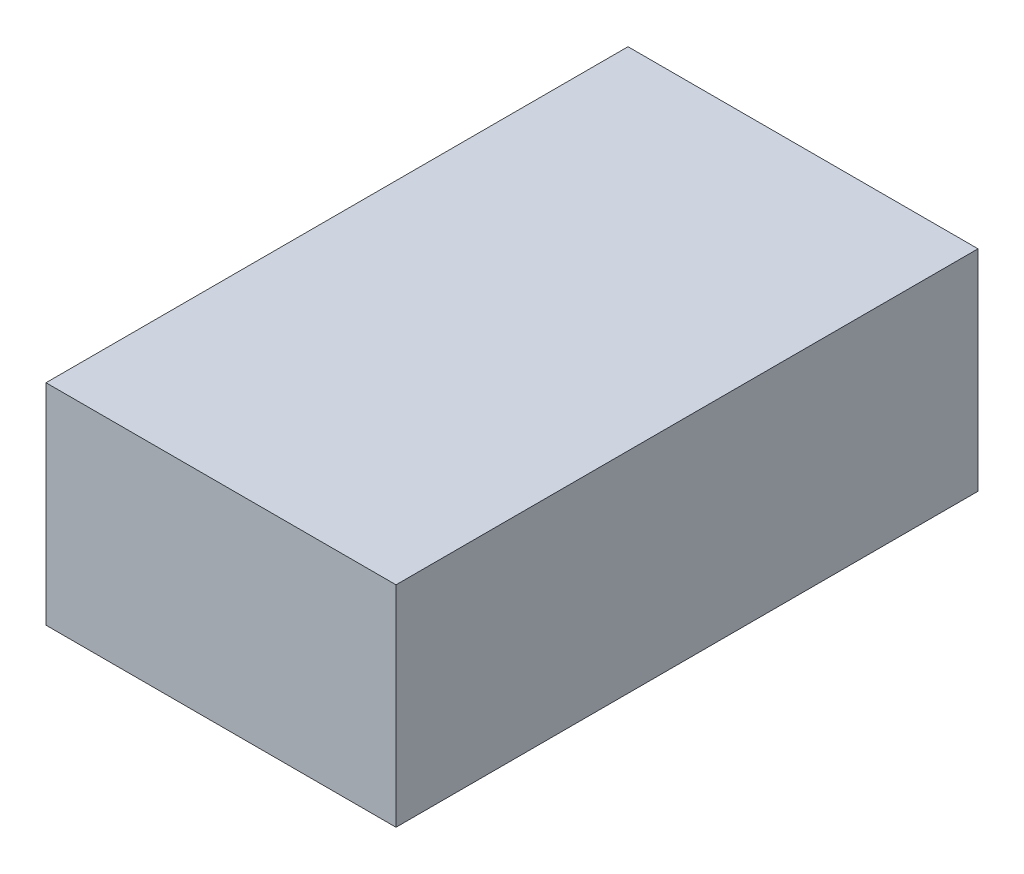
ISO-10303-21;
HEADER;
FILE_DESCRIPTION(('STEP AP214'),'2;1');
FILE_NAME('part.step','',(''),(''),'','','');
FILE_SCHEMA(('AUTOMOTIVE_DESIGN { 1 0 10303 214 1 1 1 1 }'));
ENDSEC;
DATA;
#1=APPLICATION_CONTEXT('core data for automotive mechanical design processes');
#2=APPLICATION_PROTOCOL_DEFINITION('international standard','automotive_design',2000,#1);
#3=PRODUCT_CONTEXT('',#1,'mechanical');
#4=PRODUCT('Part','Part','',(#3));
#5=PRODUCT_RELATED_PRODUCT_CATEGORY('part','',(#4));
#6=PRODUCT_DEFINITION_FORMATION('','',#4);
#7=PRODUCT_DEFINITION_CONTEXT('part definition',#1,'design');
#8=PRODUCT_DEFINITION('design','',#6,#7);
#9=PRODUCT_DEFINITION_SHAPE('','',#8);
#10=(LENGTH_UNIT() NAMED_UNIT(*) SI_UNIT(.MILLI.,.METRE.));
#11=(NAMED_UNIT(*) PLANE_ANGLE_UNIT() SI_UNIT($,.RADIAN.));
#12=(NAMED_UNIT(*) SI_UNIT($,.STERADIAN.) SOLID_ANGLE_UNIT());
#13=UNCERTAINTY_MEASURE_WITH_UNIT(LENGTH_MEASURE(1.E-05),#10,'distance_accuracy_value','');
#14=(GEOMETRIC_REPRESENTATION_CONTEXT(3) GLOBAL_UNCERTAINTY_ASSIGNED_CONTEXT((#13)) GLOBAL_UNIT_ASSIGNED_CONTEXT((#10,
#11,#12)) REPRESENTATION_CONTEXT('',''));
#15=CARTESIAN_POINT('',(0.,0.,0.));
#16=DIRECTION('',(0.,0.,1.));
#17=DIRECTION('',(1.,0.,0.));
#18=AXIS2_PLACEMENT_3D('',#15,#16,#17);
#19=CARTESIAN_POINT('',(63.4999999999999,-19.05,105.5878));
#20=DIRECTION('',(0.,1.,0.));
#21=DIRECTION('',(0.,0.,1.));
#22=AXIS2_PLACEMENT_3D('',#19,#20,#21);
#23=PLANE('',#22);
#24=DIRECTION('',(0.,0.,-1.));
#25=VECTOR('',#24,1.);
#26=CARTESIAN_POINT('',(0.,-19.05,105.5878));
#27=LINE('',#26,#25);
#28=CARTESIAN_POINT('',(0.,-19.05,105.5878));
#29=VERTEX_POINT('',#28);
#30=CARTESIAN_POINT('',(0.,-19.05,0.));
#31=VERTEX_POINT('',#30);
#32=EDGE_CURVE('E115',#29,#31,#27,.T.);
#33=ORIENTED_EDGE('',*,*,#32,.T.);
#34=DIRECTION('',(-1.,0.,0.));
#35=VECTOR('',#34,1.);
#36=CARTESIAN_POINT('',(63.4999999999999,-19.05,0.));
#37=LINE('',#36,#35);
#38=CARTESIAN_POINT('',(63.4999999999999,-19.05,0.));
#39=VERTEX_POINT('',#38);
#40=EDGE_CURVE('E11',#39,#31,#37,.T.);
#41=ORIENTED_EDGE('',*,*,#40,.F.);
#42=DIRECTION('',(0.,0.,-1.));
#43=VECTOR('',#42,1.);
#44=CARTESIAN_POINT('',(63.4999999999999,-19.05,105.5878));
#45=LINE('',#44,#43);
#46=CARTESIAN_POINT('',(63.4999999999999,-19.05,105.5878));
#47=VERTEX_POINT('',#46);
#48=EDGE_CURVE('E94',#47,#39,#45,.T.);
#49=ORIENTED_EDGE('',*,*,#48,.F.);
#50=DIRECTION('',(-1.,0.,0.));
#51=VECTOR('',#50,1.);
#52=CARTESIAN_POINT('',(63.4999999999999,-19.05,105.5878));
#53=LINE('',#52,#51);
#54=EDGE_CURVE('E106',#47,#29,#53,.T.);
#55=ORIENTED_EDGE('',*,*,#54,.T.);
#56=EDGE_LOOP('',(#33,#41,#49,#55));
#57=FACE_BOUND('',#56,.T.);
#58=ADVANCED_FACE('F43',(#57),#23,.F.);
#59=CARTESIAN_POINT('',(63.4999999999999,-19.05,0.));
#60=DIRECTION('',(0.,0.,1.));
#61=DIRECTION('',(1.,0.,0.));
#62=AXIS2_PLACEMENT_3D('',#59,#60,#61);
#63=PLANE('',#62);
#64=DIRECTION('',(0.,1.,0.));
#65=VECTOR('',#64,1.);
#66=CARTESIAN_POINT('',(0.,-19.05,0.));
#67=LINE('',#66,#65);
#68=CARTESIAN_POINT('',(0.,19.05,0.));
#69=VERTEX_POINT('',#68);
#70=EDGE_CURVE('E99',#31,#69,#67,.T.);
#71=ORIENTED_EDGE('',*,*,#70,.T.);
#72=DIRECTION('',(-1.,0.,0.));
#73=VECTOR('',#72,1.);
#74=CARTESIAN_POINT('',(63.4999999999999,19.05,0.));
#75=LINE('',#74,#73);
#76=CARTESIAN_POINT('',(63.4999999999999,19.05,0.));
#77=VERTEX_POINT('',#76);
#78=EDGE_CURVE('E55',#77,#69,#75,.T.);
#79=ORIENTED_EDGE('',*,*,#78,.F.);
#80=DIRECTION('',(0.,1.,0.));
#81=VECTOR('',#80,1.);
#82=CARTESIAN_POINT('',(63.4999999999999,-19.05,0.));
#83=LINE('',#82,#81);
#84=EDGE_CURVE('E89',#39,#77,#83,.T.);
#85=ORIENTED_EDGE('',*,*,#84,.F.);
#86=ORIENTED_EDGE('',*,*,#40,.T.);
#87=EDGE_LOOP('',(#71,#79,#85,#86));
#88=FACE_BOUND('',#87,.T.);
#89=ADVANCED_FACE('F98',(#88),#63,.F.);
#90=CARTESIAN_POINT('',(63.4999999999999,19.05,0.));
#91=DIRECTION('',(0.,-1.,0.));
#92=DIRECTION('',(0.,0.,-1.));
#93=AXIS2_PLACEMENT_3D('',#90,#91,#92);
#94=PLANE('',#93);
#95=DIRECTION('',(0.,0.,1.));
#96=VECTOR('',#95,1.);
#97=CARTESIAN_POINT('',(0.,19.05,0.));
#98=LINE('',#97,#96);
#99=CARTESIAN_POINT('',(0.,19.05,105.5878));
#100=VERTEX_POINT('',#99);
#101=EDGE_CURVE('E77',#69,#100,#98,.T.);
#102=ORIENTED_EDGE('',*,*,#101,.T.);
#103=DIRECTION('',(-1.,0.,0.));
#104=VECTOR('',#103,1.);
#105=CARTESIAN_POINT('',(63.4999999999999,19.05,105.5878));
#106=LINE('',#105,#104);
#107=CARTESIAN_POINT('',(63.4999999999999,19.05,105.5878));
#108=VERTEX_POINT('',#107);
#109=EDGE_CURVE('E105',#108,#100,#106,.T.);
#110=ORIENTED_EDGE('',*,*,#109,.F.);
#111=DIRECTION('',(0.,0.,1.));
#112=VECTOR('',#111,1.);
#113=CARTESIAN_POINT('',(63.4999999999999,19.05,0.));
#114=LINE('',#113,#112);
#115=EDGE_CURVE('E93',#77,#108,#114,.T.);
#116=ORIENTED_EDGE('',*,*,#115,.F.);
#117=ORIENTED_EDGE('',*,*,#78,.T.);
#118=EDGE_LOOP('',(#102,#110,#116,#117));
#119=FACE_BOUND('',#118,.T.);
#120=ADVANCED_FACE('F104',(#119),#94,.F.);
#121=CARTESIAN_POINT('',(63.4999999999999,19.05,105.5878));
#122=DIRECTION('',(0.,0.,-1.));
#123=DIRECTION('',(-1.,0.,0.));
#124=AXIS2_PLACEMENT_3D('',#121,#122,#123);
#125=PLANE('',#124);
#126=DIRECTION('',(0.,-1.,0.));
#127=VECTOR('',#126,1.);
#128=CARTESIAN_POINT('',(0.,19.05,105.5878));
#129=LINE('',#128,#127);
#130=EDGE_CURVE('E81',#100,#29,#129,.T.);
#131=ORIENTED_EDGE('',*,*,#130,.T.);
#132=ORIENTED_EDGE('',*,*,#54,.F.);
#133=DIRECTION('',(0.,-1.,0.));
#134=VECTOR('',#133,1.);
#135=CARTESIAN_POINT('',(63.4999999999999,19.05,105.5878));
#136=LINE('',#135,#134);
#137=EDGE_CURVE('E58',#108,#47,#136,.T.);
#138=ORIENTED_EDGE('',*,*,#137,.F.);
#139=ORIENTED_EDGE('',*,*,#109,.T.);
#140=EDGE_LOOP('',(#131,#132,#138,#139));
#141=FACE_BOUND('',#140,.T.);
#142=ADVANCED_FACE('F128',(#141),#125,.F.);
#143=CARTESIAN_POINT('',(63.4999999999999,0.,0.));
#144=DIRECTION('',(1.,0.,0.));
#145=DIRECTION('',(0.,0.,-1.));
#146=AXIS2_PLACEMENT_3D('',#143,#144,#145);
#147=PLANE('',#146);
#148=ORIENTED_EDGE('',*,*,#48,.T.);
#149=ORIENTED_EDGE('',*,*,#84,.T.);
#150=ORIENTED_EDGE('',*,*,#115,.T.);
#151=ORIENTED_EDGE('',*,*,#137,.T.);
#152=EDGE_LOOP('',(#148,#149,#150,#151));
#153=FACE_BOUND('',#152,.T.);
#154=ADVANCED_FACE('F91',(#153),#147,.T.);
#155=CARTESIAN_POINT('',(0.,0.,0.));
#156=DIRECTION('',(1.,0.,0.));
#157=DIRECTION('',(0.,0.,-1.));
#158=AXIS2_PLACEMENT_3D('',#155,#156,#157);
#159=PLANE('',#158);
#160=ORIENTED_EDGE('',*,*,#32,.F.);
#161=ORIENTED_EDGE('',*,*,#130,.F.);
#162=ORIENTED_EDGE('',*,*,#101,.F.);
#163=ORIENTED_EDGE('',*,*,#70,.F.);
#164=EDGE_LOOP('',(#160,#161,#162,#163));
#165=FACE_BOUND('',#164,.T.);
#166=ADVANCED_FACE('F129',(#165),#159,.F.);
#167=CLOSED_SHELL('',(#58,#89,#120,#142,#154,#166));
#168=MANIFOLD_SOLID_BREP('B2',#167);
#169=ADVANCED_BREP_SHAPE_REPRESENTATION('',(#18,#168),#14);
#170=SHAPE_DEFINITION_REPRESENTATION(#9,#169);
ENDSEC;
END-ISO-10303-21;
